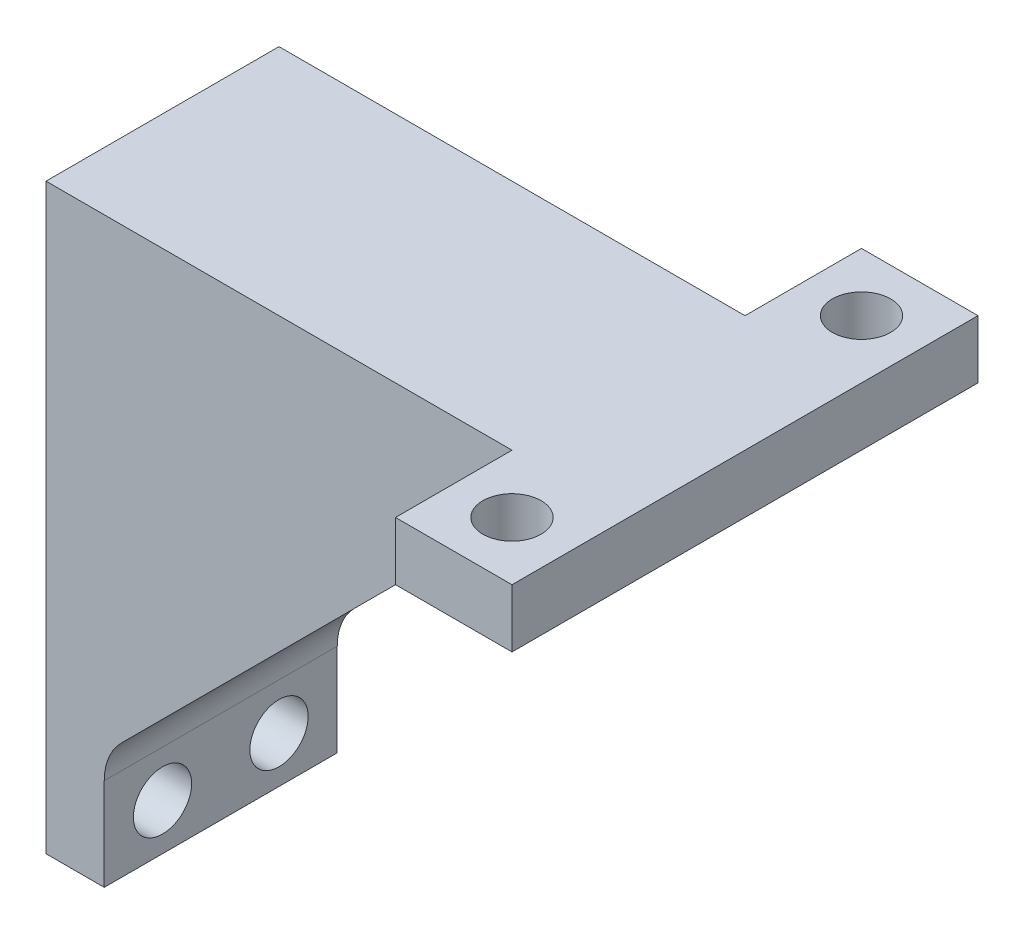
from build123d import *

# Parameters (mm, degrees)
BOSS_EXTRUDE1_DEPTH = 40
BOSS_EXTRUDE2_DEPTH = 10
SKETCH3_W           = 40
SKETCH3_H           = 100
BOSS_EXTRUDE3_DEPTH = 10
FILLET1_R           = 10
SKETCH4_R           = 5
CUT_EXTRUDE1_DEPTH  = 10
SKETCH5_R           = 5
CUT_EXTRUDE2_DEPTH  = 10


with BuildPart() as part:
    # Sketch1 → Boss-Extrude1 (new body)
    with BuildSketch(Plane.XY):
        Polygon((0, 0), (0, 70), (70, 70), align=None)
    extrude(amount=BOSS_EXTRUDE1_DEPTH)

    # Sketch2 → Boss-Extrude2 (add)
    with BuildSketch(Plane(origin=(0, 70, 0), x_dir=(1, 0, 0), z_dir=(0, 1, 0))):
        Polygon((70, -40), (70, -60), (90, -60), (90, 20), (70, 20), (70, 0), (0, 0), (0, -40), align=None)
    extrude(amount=BOSS_EXTRUDE2_DEPTH)

    # Sketch3 → Boss-Extrude3 (add)
    with BuildSketch(Plane.ZY):
        with Locations((20, 30)):
            Rectangle(SKETCH3_W, SKETCH3_H)
    extrude(amount=BOSS_EXTRUDE3_DEPTH)

    # Fillet1
    fillet1_edges = [part.edges().sort_by_distance(p)[0] for p in [
        (0, 0, 20),
        (70, 70, 20),
    ]]
    fillet(fillet1_edges, radius=FILLET1_R)

    # Sketch4 → Cut-Extrude1 (cut)
    with BuildSketch(Plane.XZ.offset(-70)):
        with Locations(Location((80, -10, 0), (0, 0, 270))):
            Circle(SKETCH4_R)
        with Locations(Location((80, 50, 0), (0, 0, 270))):
            Circle(SKETCH4_R)
    extrude(amount=-CUT_EXTRUDE1_DEPTH, mode=Mode.SUBTRACT)

    # Sketch5 → Cut-Extrude2 (cut)
    with BuildSketch(Plane.YZ):
        with Locations(Location((-12.071067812, 10, 0), (0, 0, 270))):
            Circle(SKETCH5_R)
        with Locations(Location((-12.071067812, 30, 0), (0, 0, 270))):
            Circle(SKETCH5_R)
    extrude(amount=-CUT_EXTRUDE2_DEPTH, mode=Mode.SUBTRACT)


solid = part.part
